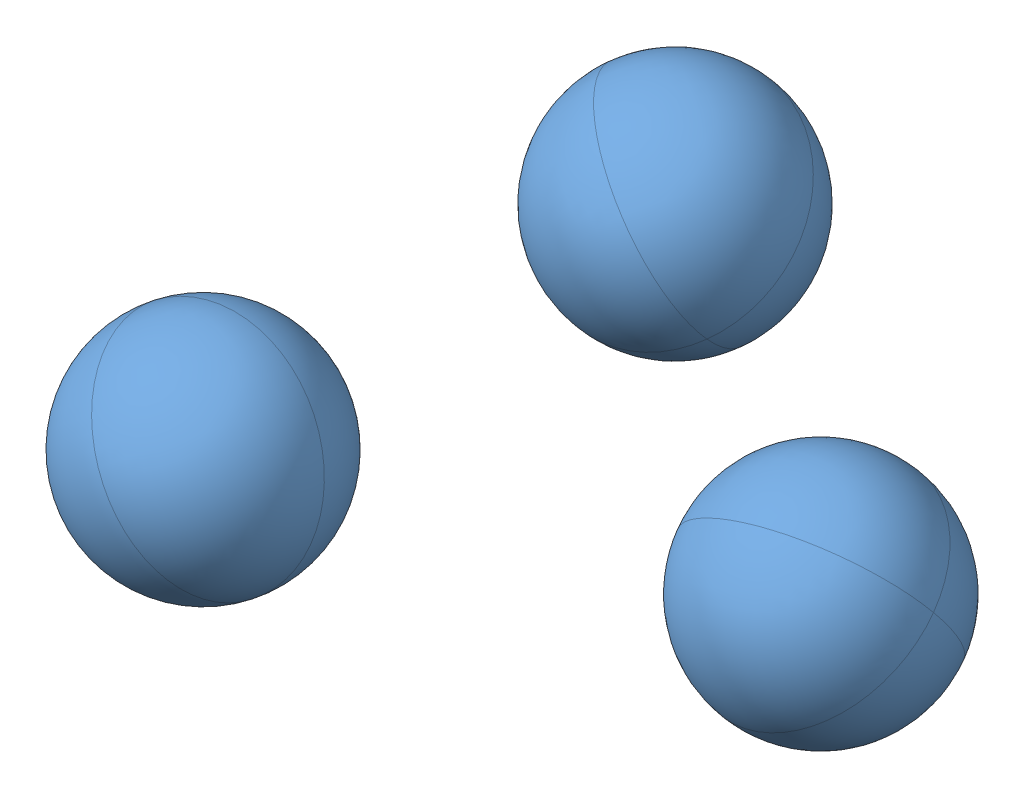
SolidWorks assembly Rolling Balls.SLDASM, configuration Default (file format 3100). Lengths in mm.
Overall size (171.47 85.67 179.77).
4 component instances, 2 part files, 3 mates.
Components (placement in the parent):
- Floor-1: Floor.SLDPRT [Default] at origin (suppressed, hidden)
- Sphere-1: Sphere.SLDPRT [Default] at (45.4162 25.4 -34.3824) x (-0.205595 0.772243 0.601142) z (-0.22851 0.559403 -0.796776) size (50.8 50.8 50.8)
- Sphere-2: Sphere.SLDPRT [Default] at (-53.689 25.4 7.6037) x (0.797156 0.569461 -0.200638) z (0.066091 0.248009 0.966501) size (50.8 50.8 50.8)
- Sphere-3: Sphere.SLDPRT [Default] at (-48.3717 25.4 -94.8666) x (0.002833 -0.741577 -0.670862) z (0.643272 0.514989 -0.566557) size (50.8 50.8 50.8)
Mates (geometry in assembly coordinates):
- Tangent1: tangent anti-aligned: sphere of Sphere-1; plane of assembly
- Tangent2: tangent anti-aligned: sphere of Sphere-3; plane of assembly
- Tangent3: tangent anti-aligned: sphere of Sphere-2; plane of assembly
